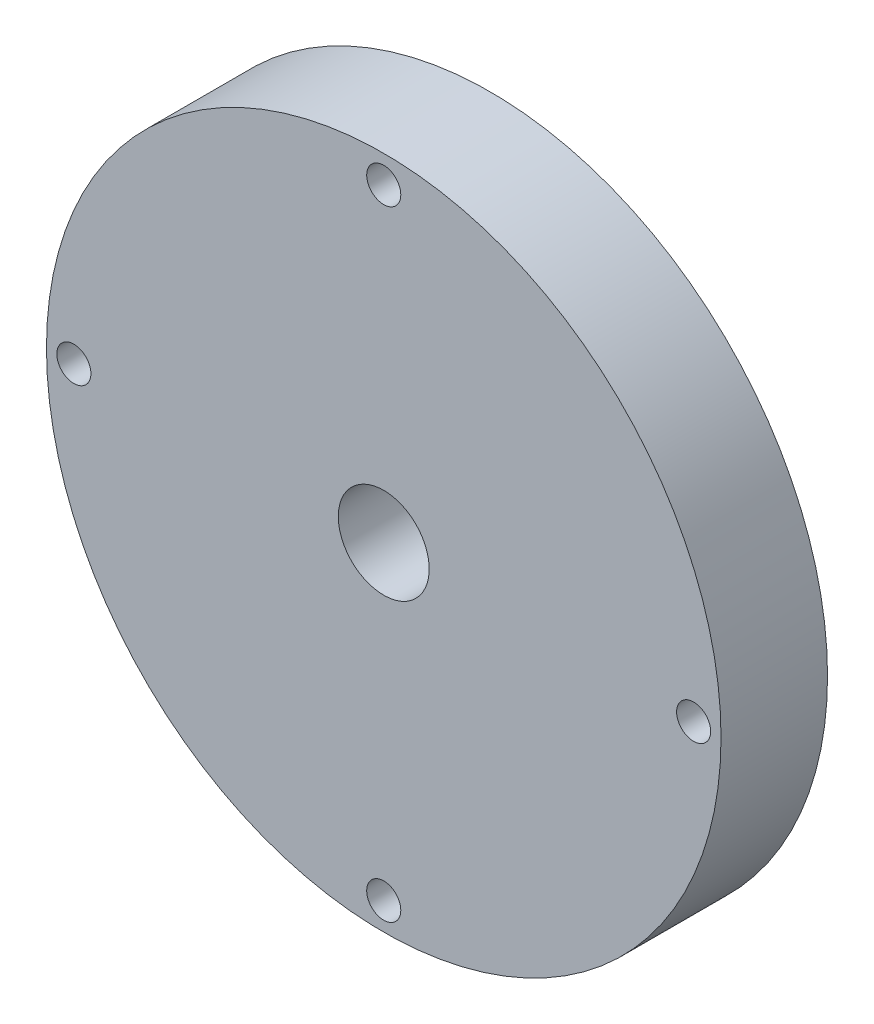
from build123d import *

# Parameters (mm, degrees)
SKETCH1_R                  = 30.1625
SKETCH1_R_2                = 4.064
BOSS_EXTRUDE1_DEPTH        = 9.525
F_31_0_12_DIAMETER_HOLE1_D = 3.048


with BuildPart() as part:
    # Sketch1 → Boss-Extrude1 (new body)
    with BuildSketch(Plane.XY):
        with Locations(Location((0, 0, 0), (0, 0, 180))):
            Circle(SKETCH1_R)
        with Locations(Location((0, 0, 0), (0, 0, 180))):
            Circle(SKETCH1_R_2, mode=Mode.SUBTRACT)
    extrude(amount=BOSS_EXTRUDE1_DEPTH)

    # 31 _0.12_ Diameter Hole1 (through all)
    with Locations(Plane.XY.offset(9.525)):
        with Locations((0, 27.7114), (27.7114, 0), (0, -27.7114), (-27.7114, 0)):
            Hole(F_31_0_12_DIAMETER_HOLE1_D / 2)


solid = part.part
